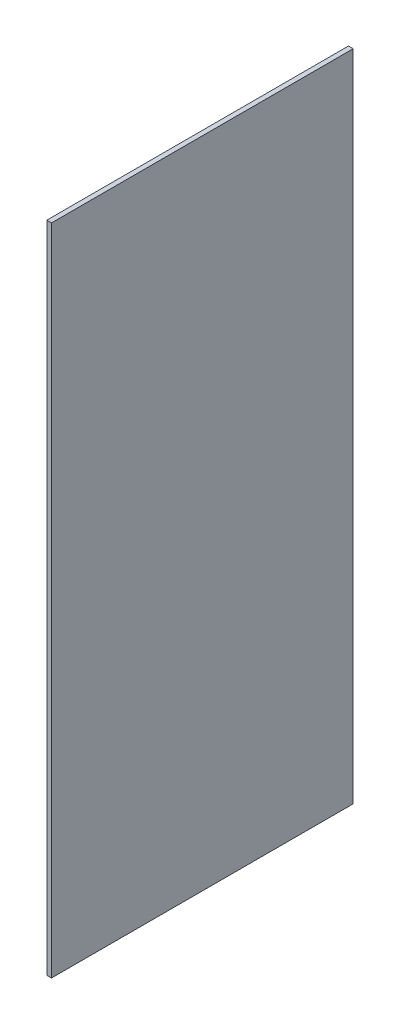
ISO-10303-21;
HEADER;
FILE_DESCRIPTION(('STEP AP214'),'2;1');
FILE_NAME('part.step','',(''),(''),'','','');
FILE_SCHEMA(('AUTOMOTIVE_DESIGN { 1 0 10303 214 1 1 1 1 }'));
ENDSEC;
DATA;
#1=APPLICATION_CONTEXT('core data for automotive mechanical design processes');
#2=APPLICATION_PROTOCOL_DEFINITION('international standard','automotive_design',2000,#1);
#3=PRODUCT_CONTEXT('',#1,'mechanical');
#4=PRODUCT('Part','Part','',(#3));
#5=PRODUCT_RELATED_PRODUCT_CATEGORY('part','',(#4));
#6=PRODUCT_DEFINITION_FORMATION('','',#4);
#7=PRODUCT_DEFINITION_CONTEXT('part definition',#1,'design');
#8=PRODUCT_DEFINITION('design','',#6,#7);
#9=PRODUCT_DEFINITION_SHAPE('','',#8);
#10=(LENGTH_UNIT() NAMED_UNIT(*) SI_UNIT(.MILLI.,.METRE.));
#11=(NAMED_UNIT(*) PLANE_ANGLE_UNIT() SI_UNIT($,.RADIAN.));
#12=(NAMED_UNIT(*) SI_UNIT($,.STERADIAN.) SOLID_ANGLE_UNIT());
#13=UNCERTAINTY_MEASURE_WITH_UNIT(LENGTH_MEASURE(1.E-05),#10,'distance_accuracy_value','');
#14=(GEOMETRIC_REPRESENTATION_CONTEXT(3) GLOBAL_UNCERTAINTY_ASSIGNED_CONTEXT((#13)) GLOBAL_UNIT_ASSIGNED_CONTEXT((#10,
#11,#12)) REPRESENTATION_CONTEXT('',''));
#15=CARTESIAN_POINT('',(0.,0.,0.));
#16=DIRECTION('',(0.,0.,1.));
#17=DIRECTION('',(1.,0.,0.));
#18=AXIS2_PLACEMENT_3D('',#15,#16,#17);
#19=CARTESIAN_POINT('',(-4.76249999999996,1321.48771151,304.8));
#20=DIRECTION('',(1.,0.,0.));
#21=DIRECTION('',(0.,0.,-1.));
#22=AXIS2_PLACEMENT_3D('',#19,#20,#21);
#23=PLANE('',#22);
#24=DIRECTION('',(0.,0.,1.));
#25=VECTOR('',#24,1.);
#26=CARTESIAN_POINT('',(-4.76249999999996,0.,304.8));
#27=LINE('',#26,#25);
#28=CARTESIAN_POINT('',(-4.76250000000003,0.,-304.8));
#29=VERTEX_POINT('',#28);
#30=CARTESIAN_POINT('',(-4.76249999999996,0.,304.8));
#31=VERTEX_POINT('',#30);
#32=EDGE_CURVE('E113',#29,#31,#27,.T.);
#33=ORIENTED_EDGE('',*,*,#32,.T.);
#34=DIRECTION('',(0.,-1.,0.));
#35=VECTOR('',#34,1.);
#36=CARTESIAN_POINT('',(-4.76249999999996,1321.48771151,304.8));
#37=LINE('',#36,#35);
#38=CARTESIAN_POINT('',(-4.76249999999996,1321.48771151,304.8));
#39=VERTEX_POINT('',#38);
#40=EDGE_CURVE('E11',#39,#31,#37,.T.);
#41=ORIENTED_EDGE('',*,*,#40,.F.);
#42=DIRECTION('',(0.,0.,1.));
#43=VECTOR('',#42,1.);
#44=CARTESIAN_POINT('',(-4.76249999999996,1321.48771151,304.8));
#45=LINE('',#44,#43);
#46=CARTESIAN_POINT('',(-4.76250000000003,1321.48771151,-304.8));
#47=VERTEX_POINT('',#46);
#48=EDGE_CURVE('E97',#47,#39,#45,.T.);
#49=ORIENTED_EDGE('',*,*,#48,.F.);
#50=DIRECTION('',(0.,-1.,0.));
#51=VECTOR('',#50,1.);
#52=CARTESIAN_POINT('',(-4.76250000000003,1321.48771151,-304.8));
#53=LINE('',#52,#51);
#54=EDGE_CURVE('E107',#47,#29,#53,.T.);
#55=ORIENTED_EDGE('',*,*,#54,.T.);
#56=EDGE_LOOP('',(#33,#41,#49,#55));
#57=FACE_BOUND('',#56,.T.);
#58=ADVANCED_FACE('F44',(#57),#23,.F.);
#59=CARTESIAN_POINT('',(4.76250000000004,1321.48771151,304.8));
#60=DIRECTION('',(0.,0.,-1.));
#61=DIRECTION('',(-1.,0.,0.));
#62=AXIS2_PLACEMENT_3D('',#59,#60,#61);
#63=PLANE('',#62);
#64=DIRECTION('',(1.,0.,0.));
#65=VECTOR('',#64,1.);
#66=CARTESIAN_POINT('',(4.76250000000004,0.,304.8));
#67=LINE('',#66,#65);
#68=CARTESIAN_POINT('',(4.76250000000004,0.,304.8));
#69=VERTEX_POINT('',#68);
#70=EDGE_CURVE('E105',#31,#69,#67,.T.);
#71=ORIENTED_EDGE('',*,*,#70,.T.);
#72=DIRECTION('',(0.,-1.,0.));
#73=VECTOR('',#72,1.);
#74=CARTESIAN_POINT('',(4.76250000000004,1321.48771151,304.8));
#75=LINE('',#74,#73);
#76=CARTESIAN_POINT('',(4.76250000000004,1321.48771151,304.8));
#77=VERTEX_POINT('',#76);
#78=EDGE_CURVE('E53',#77,#69,#75,.T.);
#79=ORIENTED_EDGE('',*,*,#78,.F.);
#80=DIRECTION('',(1.,0.,0.));
#81=VECTOR('',#80,1.);
#82=CARTESIAN_POINT('',(4.76250000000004,1321.48771151,304.8));
#83=LINE('',#82,#81);
#84=EDGE_CURVE('E95',#39,#77,#83,.T.);
#85=ORIENTED_EDGE('',*,*,#84,.F.);
#86=ORIENTED_EDGE('',*,*,#40,.T.);
#87=EDGE_LOOP('',(#71,#79,#85,#86));
#88=FACE_BOUND('',#87,.T.);
#89=ADVANCED_FACE('F103',(#88),#63,.F.);
#90=CARTESIAN_POINT('',(4.76250000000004,1321.48771151,304.8));
#91=DIRECTION('',(-1.,0.,0.));
#92=DIRECTION('',(0.,0.,1.));
#93=AXIS2_PLACEMENT_3D('',#90,#91,#92);
#94=PLANE('',#93);
#95=DIRECTION('',(0.,0.,-1.));
#96=VECTOR('',#95,1.);
#97=CARTESIAN_POINT('',(4.76250000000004,0.,304.8));
#98=LINE('',#97,#96);
#99=CARTESIAN_POINT('',(4.76249999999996,0.,-304.8));
#100=VERTEX_POINT('',#99);
#101=EDGE_CURVE('E79',#69,#100,#98,.T.);
#102=ORIENTED_EDGE('',*,*,#101,.T.);
#103=DIRECTION('',(0.,-1.,0.));
#104=VECTOR('',#103,1.);
#105=CARTESIAN_POINT('',(4.76249999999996,1321.48771151,-304.8));
#106=LINE('',#105,#104);
#107=CARTESIAN_POINT('',(4.76249999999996,1321.48771151,-304.8));
#108=VERTEX_POINT('',#107);
#109=EDGE_CURVE('E104',#108,#100,#106,.T.);
#110=ORIENTED_EDGE('',*,*,#109,.F.);
#111=DIRECTION('',(0.,0.,-1.));
#112=VECTOR('',#111,1.);
#113=CARTESIAN_POINT('',(4.76250000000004,1321.48771151,304.8));
#114=LINE('',#113,#112);
#115=EDGE_CURVE('E94',#77,#108,#114,.T.);
#116=ORIENTED_EDGE('',*,*,#115,.F.);
#117=ORIENTED_EDGE('',*,*,#78,.T.);
#118=EDGE_LOOP('',(#102,#110,#116,#117));
#119=FACE_BOUND('',#118,.T.);
#120=ADVANCED_FACE('F102',(#119),#94,.F.);
#121=CARTESIAN_POINT('',(4.76249999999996,1321.48771151,-304.8));
#122=DIRECTION('',(0.,0.,1.));
#123=DIRECTION('',(1.,0.,0.));
#124=AXIS2_PLACEMENT_3D('',#121,#122,#123);
#125=PLANE('',#124);
#126=DIRECTION('',(-1.,0.,0.));
#127=VECTOR('',#126,1.);
#128=CARTESIAN_POINT('',(4.76249999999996,0.,-304.8));
#129=LINE('',#128,#127);
#130=EDGE_CURVE('E83',#100,#29,#129,.T.);
#131=ORIENTED_EDGE('',*,*,#130,.T.);
#132=ORIENTED_EDGE('',*,*,#54,.F.);
#133=DIRECTION('',(-1.,0.,0.));
#134=VECTOR('',#133,1.);
#135=CARTESIAN_POINT('',(4.76249999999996,1321.48771151,-304.8));
#136=LINE('',#135,#134);
#137=EDGE_CURVE('E65',#108,#47,#136,.T.);
#138=ORIENTED_EDGE('',*,*,#137,.F.);
#139=ORIENTED_EDGE('',*,*,#109,.T.);
#140=EDGE_LOOP('',(#131,#132,#138,#139));
#141=FACE_BOUND('',#140,.T.);
#142=ADVANCED_FACE('F127',(#141),#125,.F.);
#143=CARTESIAN_POINT('',(0.,1321.48771151,0.));
#144=DIRECTION('',(0.,1.,0.));
#145=DIRECTION('',(0.,0.,1.));
#146=AXIS2_PLACEMENT_3D('',#143,#144,#145);
#147=PLANE('',#146);
#148=ORIENTED_EDGE('',*,*,#48,.T.);
#149=ORIENTED_EDGE('',*,*,#84,.T.);
#150=ORIENTED_EDGE('',*,*,#115,.T.);
#151=ORIENTED_EDGE('',*,*,#137,.T.);
#152=EDGE_LOOP('',(#148,#149,#150,#151));
#153=FACE_BOUND('',#152,.T.);
#154=ADVANCED_FACE('F91',(#153),#147,.T.);
#155=CARTESIAN_POINT('',(0.,0.,0.));
#156=DIRECTION('',(0.,1.,0.));
#157=DIRECTION('',(0.,0.,1.));
#158=AXIS2_PLACEMENT_3D('',#155,#156,#157);
#159=PLANE('',#158);
#160=ORIENTED_EDGE('',*,*,#32,.F.);
#161=ORIENTED_EDGE('',*,*,#130,.F.);
#162=ORIENTED_EDGE('',*,*,#101,.F.);
#163=ORIENTED_EDGE('',*,*,#70,.F.);
#164=EDGE_LOOP('',(#160,#161,#162,#163));
#165=FACE_BOUND('',#164,.T.);
#166=ADVANCED_FACE('F126',(#165),#159,.F.);
#167=CLOSED_SHELL('',(#58,#89,#120,#142,#154,#166));
#168=MANIFOLD_SOLID_BREP('B2',#167);
#169=ADVANCED_BREP_SHAPE_REPRESENTATION('',(#18,#168),#14);
#170=SHAPE_DEFINITION_REPRESENTATION(#9,#169);
ENDSEC;
END-ISO-10303-21;
